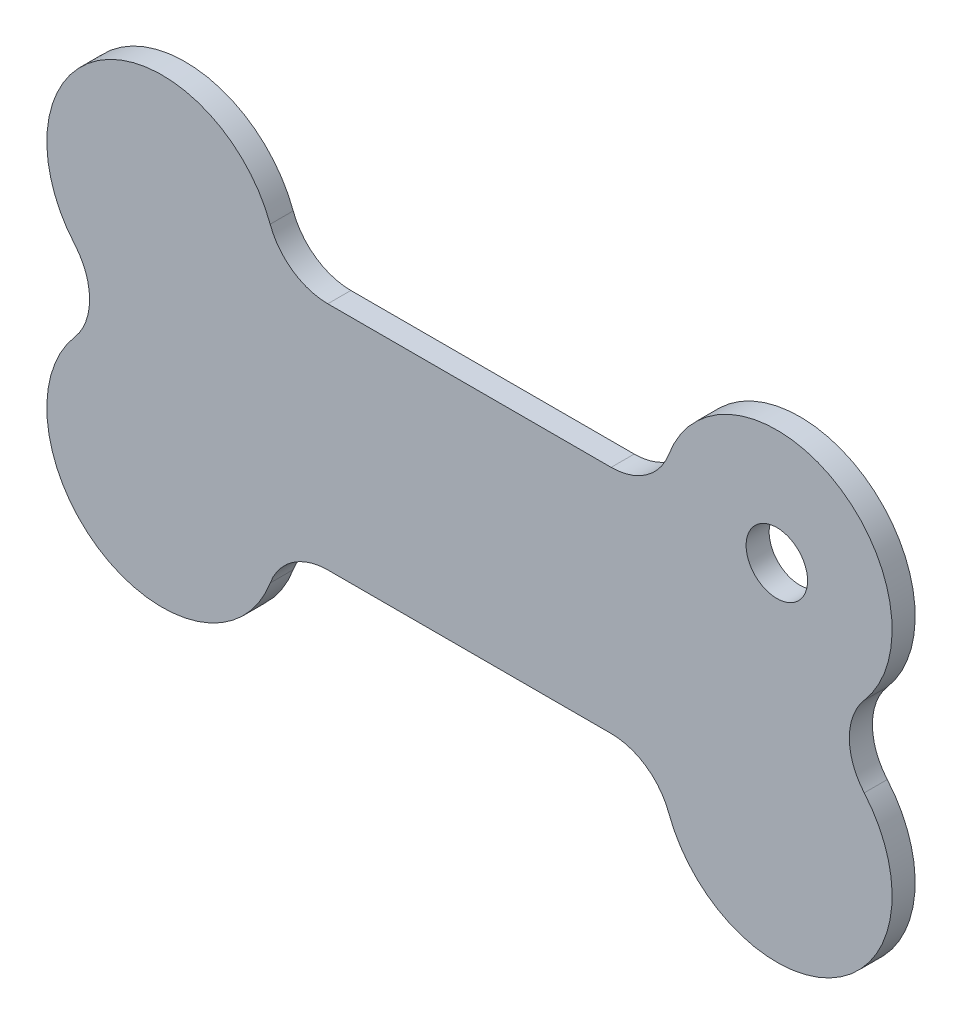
from build123d import *

# Parameters (mm, degrees)
ESQUISSE1_R    = 2
M_DAILLE_DEPTH = 1.5


with BuildPart() as part:
    # Esquisse1 → M_daille (new body)
    with BuildSketch(Plane.XY):
        with BuildLine():
            Line((9.218070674, 7.5), (-9.218070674, 7.5))
            ThreePointArc((-9.218070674, 7.5), (-11.502231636, 8.216311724), (-12.968306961, 10.108695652))
            ThreePointArc((-12.968306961, 10.108695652), (-23.809927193, 13.960220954), (-25.685520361, 2.608695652))
            ThreePointArc((-25.685520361, 2.608695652), (-24.717797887, 0), (-25.685520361, -2.608695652))
            ThreePointArc((-25.685520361, -2.608695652), (-23.809927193, -13.960220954), (-12.968306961, -10.108695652))
            ThreePointArc((-12.968306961, -10.108695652), (-11.502231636, -8.216311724), (-9.218070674, -7.5))
            Line((-9.218070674, -7.5), (9.218070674, -7.5))
            ThreePointArc((9.218070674, -7.5), (11.502231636, -8.216311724), (12.968306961, -10.108695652))
            ThreePointArc((12.968306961, -10.108695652), (23.809927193, -13.960220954), (25.685520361, -2.608695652))
            ThreePointArc((25.685520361, -2.608695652), (24.717797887, 0), (25.685520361, 2.608695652))
            ThreePointArc((25.685520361, 2.608695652), (23.809927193, 13.960220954), (12.968306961, 10.108695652))
            ThreePointArc((12.968306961, 10.108695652), (11.502231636, 8.216311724), (9.218070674, 7.5))
        make_face()
        with Locations((20, 7.5)):
            Circle(ESQUISSE1_R, mode=Mode.SUBTRACT)
    extrude(amount=M_DAILLE_DEPTH)


solid = part.part
